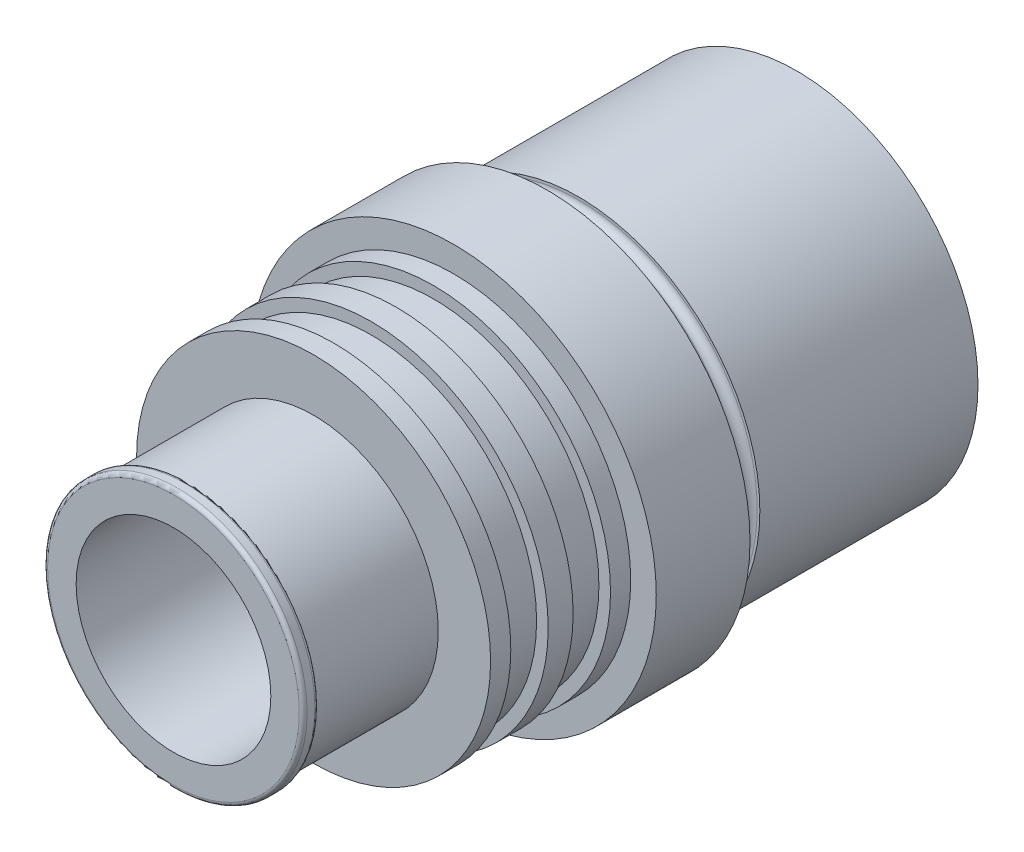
from build123d import *

# Parameters (mm, degrees)
FILLET1_R     = 0.79375
CHAMFER1_SIZE = 1.5875
FILLET2_R     = 0.396875


with BuildPart() as part:
    # Sketch1 → Revolve1 (revolve)
    with BuildSketch(Plane(origin=(0, 0, 0), x_dir=(0, 0, -1), z_dir=(1, 0, 0)), mode=Mode.PRIVATE) as revolve1_sk:
        Polygon((-31.75, 0), (-31.75, 13.2207), (-30.1625, 13.2207), (-30.1625, 12.7), (-17.4752, 12.7), (-17.4752, 18.034), (-15.4178, 18.034), (-15.4178, 16.8529), (-11.6078, 16.8529), (-11.6078, 18.034), (-9.0678, 18.034), (-9.0678, 16.8529), (-5.2578, 16.8529), (-5.2578, 18.034), (-3.2004, 18.034), (-3.2004, 20.6375), (6.35, 20.6375), (6.35, 17.399), (9.525, 17.399), (9.525, 18.4658), (31.75, 18.4658), (31.75, 0), align=None)
    revolve(revolve1_sk.sketch.rotate(Axis((0, 0, 38.724567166), (0, 0, -1)), 90), axis=Axis((0, 0, 38.724567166), (0, 0, -1)))

    # Sketch2 → Cut-Revolve1 (revolve, cut)
    with BuildSketch(Plane(origin=(0, 0, 0), x_dir=(0, 0, -1), z_dir=(1, 0, 0)), mode=Mode.PRIVATE) as cut_revolve1_sk:
        Polygon((-31.75, 9.9187), (-15.08125, 9.9187), (-15.08125, 11.90625), (-9.525, 11.90625), (-6.35, 15.08125), (31.75, 15.08125), (31.75, 0), (-31.75, 0), align=None)
    revolve(cut_revolve1_sk.sketch.rotate(Axis((0, 0, 35.166909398), (0, 0, -1)), 90), axis=Axis((0, 0, 35.166909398), (0, 0, -1)), mode=Mode.SUBTRACT)

    # Fillet1
    fillet1_edges = [part.edges().sort_by_distance(p)[0] for p in [
        (-17.399, 0, -9.525),
        (-17.399, 0, -6.35),
    ]]
    fillet(fillet1_edges, radius=FILLET1_R)

    # Chamfer1
    chamfer1_edges = [part.edges().sort_by_distance(p)[0] for p in [
        (-15.08125, 0, -31.75),
    ]]
    chamfer(chamfer1_edges, length=CHAMFER1_SIZE)

    # Fillet2
    fillet2_edges = [part.edges().sort_by_distance(p)[0] for p in [
        (-13.2207, 0, 30.1625),
        (-13.2207, 0, 31.75),
    ]]
    fillet(fillet2_edges, radius=FILLET2_R)


solid = part.part
